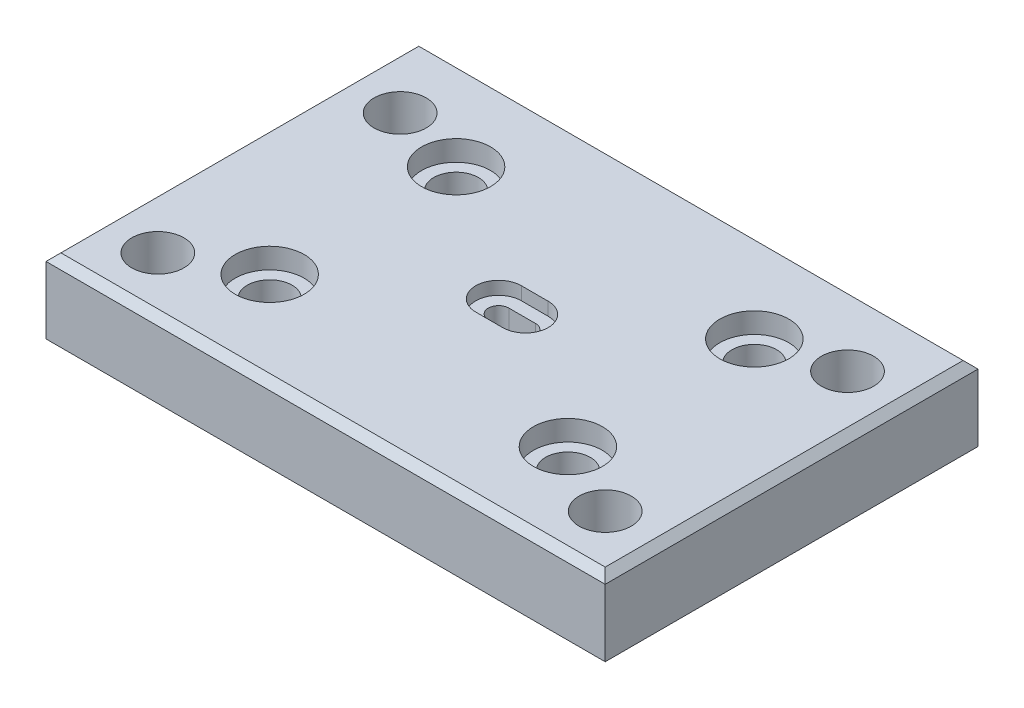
ISO-10303-21;
HEADER;
FILE_DESCRIPTION(('STEP AP214'),'2;1');
FILE_NAME('part.step','',(''),(''),'','','');
FILE_SCHEMA(('AUTOMOTIVE_DESIGN { 1 0 10303 214 1 1 1 1 }'));
ENDSEC;
DATA;
#1=APPLICATION_CONTEXT('core data for automotive mechanical design processes');
#2=APPLICATION_PROTOCOL_DEFINITION('international standard','automotive_design',2000,#1);
#3=PRODUCT_CONTEXT('',#1,'mechanical');
#4=PRODUCT('Part','Part','',(#3));
#5=PRODUCT_RELATED_PRODUCT_CATEGORY('part','',(#4));
#6=PRODUCT_DEFINITION_FORMATION('','',#4);
#7=PRODUCT_DEFINITION_CONTEXT('part definition',#1,'design');
#8=PRODUCT_DEFINITION('design','',#6,#7);
#9=PRODUCT_DEFINITION_SHAPE('','',#8);
#10=(LENGTH_UNIT() NAMED_UNIT(*) SI_UNIT(.MILLI.,.METRE.));
#11=(NAMED_UNIT(*) PLANE_ANGLE_UNIT() SI_UNIT($,.RADIAN.));
#12=(NAMED_UNIT(*) SI_UNIT($,.STERADIAN.) SOLID_ANGLE_UNIT());
#13=UNCERTAINTY_MEASURE_WITH_UNIT(LENGTH_MEASURE(1.E-05),#10,'distance_accuracy_value','');
#14=(GEOMETRIC_REPRESENTATION_CONTEXT(3) GLOBAL_UNCERTAINTY_ASSIGNED_CONTEXT((#13)) GLOBAL_UNIT_ASSIGNED_CONTEXT((#10,
#11,#12)) REPRESENTATION_CONTEXT('',''));
#15=CARTESIAN_POINT('',(0.,0.,0.));
#16=DIRECTION('',(0.,0.,1.));
#17=DIRECTION('',(1.,0.,0.));
#18=AXIS2_PLACEMENT_3D('',#15,#16,#17);
#19=CARTESIAN_POINT('',(-75.,20.,-50.));
#20=DIRECTION('',(1.,0.,0.));
#21=DIRECTION('',(0.,0.,-1.));
#22=AXIS2_PLACEMENT_3D('',#19,#20,#21);
#23=PLANE('',#22);
#24=DIRECTION('',(0.,-1.,0.));
#25=VECTOR('',#24,1.);
#26=CARTESIAN_POINT('',(-75.,20.,50.));
#27=LINE('',#26,#25);
#28=CARTESIAN_POINT('',(-75.,18.,50.));
#29=VERTEX_POINT('',#28);
#30=CARTESIAN_POINT('',(-75.,0.,50.));
#31=VERTEX_POINT('',#30);
#32=EDGE_CURVE('E322',#29,#31,#27,.T.);
#33=ORIENTED_EDGE('',*,*,#32,.F.);
#34=DIRECTION('',(0.,0.,-1.));
#35=VECTOR('',#34,1.);
#36=CARTESIAN_POINT('',(-75.,18.,-50.));
#37=LINE('',#36,#35);
#38=CARTESIAN_POINT('',(-75.,18.,-50.));
#39=VERTEX_POINT('',#38);
#40=EDGE_CURVE('E333',#29,#39,#37,.T.);
#41=ORIENTED_EDGE('',*,*,#40,.T.);
#42=DIRECTION('',(0.,-1.,0.));
#43=VECTOR('',#42,1.);
#44=CARTESIAN_POINT('',(-75.,20.,-50.));
#45=LINE('',#44,#43);
#46=CARTESIAN_POINT('',(-75.,0.,-50.));
#47=VERTEX_POINT('',#46);
#48=EDGE_CURVE('E316',#39,#47,#45,.T.);
#49=ORIENTED_EDGE('',*,*,#48,.T.);
#50=DIRECTION('',(0.,0.,1.));
#51=VECTOR('',#50,1.);
#52=CARTESIAN_POINT('',(-75.,0.,-50.));
#53=LINE('',#52,#51);
#54=EDGE_CURVE('E303',#47,#31,#53,.T.);
#55=ORIENTED_EDGE('',*,*,#54,.T.);
#56=EDGE_LOOP('',(#33,#41,#49,#55));
#57=FACE_BOUND('',#56,.T.);
#58=ADVANCED_FACE('F108',(#57),#23,.F.);
#59=CARTESIAN_POINT('',(-75.,20.,50.));
#60=DIRECTION('',(0.,0.,-1.));
#61=DIRECTION('',(-1.,0.,0.));
#62=AXIS2_PLACEMENT_3D('',#59,#60,#61);
#63=PLANE('',#62);
#64=DIRECTION('',(0.,-1.,0.));
#65=VECTOR('',#64,1.);
#66=CARTESIAN_POINT('',(75.,20.,50.));
#67=LINE('',#66,#65);
#68=CARTESIAN_POINT('',(75.,18.,50.));
#69=VERTEX_POINT('',#68);
#70=CARTESIAN_POINT('',(75.,0.,50.));
#71=VERTEX_POINT('',#70);
#72=EDGE_CURVE('E320',#69,#71,#67,.T.);
#73=ORIENTED_EDGE('',*,*,#72,.F.);
#74=DIRECTION('',(-1.,0.,0.));
#75=VECTOR('',#74,1.);
#76=CARTESIAN_POINT('',(-75.,18.,50.));
#77=LINE('',#76,#75);
#78=EDGE_CURVE('E340',#69,#29,#77,.T.);
#79=ORIENTED_EDGE('',*,*,#78,.T.);
#80=ORIENTED_EDGE('',*,*,#32,.T.);
#81=DIRECTION('',(1.,0.,0.));
#82=VECTOR('',#81,1.);
#83=CARTESIAN_POINT('',(-75.,0.,50.));
#84=LINE('',#83,#82);
#85=EDGE_CURVE('E306',#31,#71,#84,.T.);
#86=ORIENTED_EDGE('',*,*,#85,.T.);
#87=EDGE_LOOP('',(#73,#79,#80,#86));
#88=FACE_BOUND('',#87,.T.);
#89=ADVANCED_FACE('F417',(#88),#63,.F.);
#90=CARTESIAN_POINT('',(75.,20.,-50.));
#91=DIRECTION('',(-1.,0.,0.));
#92=DIRECTION('',(0.,0.,1.));
#93=AXIS2_PLACEMENT_3D('',#90,#91,#92);
#94=PLANE('',#93);
#95=DIRECTION('',(0.,-1.,0.));
#96=VECTOR('',#95,1.);
#97=CARTESIAN_POINT('',(75.,20.,-50.));
#98=LINE('',#97,#96);
#99=CARTESIAN_POINT('',(75.,18.,-50.));
#100=VERTEX_POINT('',#99);
#101=CARTESIAN_POINT('',(75.,0.,-50.));
#102=VERTEX_POINT('',#101);
#103=EDGE_CURVE('E318',#100,#102,#98,.T.);
#104=ORIENTED_EDGE('',*,*,#103,.F.);
#105=DIRECTION('',(0.,0.,1.));
#106=VECTOR('',#105,1.);
#107=CARTESIAN_POINT('',(75.,18.,50.));
#108=LINE('',#107,#106);
#109=EDGE_CURVE('E338',#100,#69,#108,.T.);
#110=ORIENTED_EDGE('',*,*,#109,.T.);
#111=ORIENTED_EDGE('',*,*,#72,.T.);
#112=DIRECTION('',(0.,0.,-1.));
#113=VECTOR('',#112,1.);
#114=CARTESIAN_POINT('',(75.,0.,-50.));
#115=LINE('',#114,#113);
#116=EDGE_CURVE('E310',#71,#102,#115,.T.);
#117=ORIENTED_EDGE('',*,*,#116,.T.);
#118=EDGE_LOOP('',(#104,#110,#111,#117));
#119=FACE_BOUND('',#118,.T.);
#120=ADVANCED_FACE('F423',(#119),#94,.F.);
#121=CARTESIAN_POINT('',(-75.,20.,-50.));
#122=DIRECTION('',(0.,0.,1.));
#123=DIRECTION('',(1.,0.,0.));
#124=AXIS2_PLACEMENT_3D('',#121,#122,#123);
#125=PLANE('',#124);
#126=ORIENTED_EDGE('',*,*,#48,.F.);
#127=DIRECTION('',(1.,0.,0.));
#128=VECTOR('',#127,1.);
#129=CARTESIAN_POINT('',(75.,18.,-50.));
#130=LINE('',#129,#128);
#131=EDGE_CURVE('E336',#39,#100,#130,.T.);
#132=ORIENTED_EDGE('',*,*,#131,.T.);
#133=ORIENTED_EDGE('',*,*,#103,.T.);
#134=DIRECTION('',(-1.,0.,0.));
#135=VECTOR('',#134,1.);
#136=CARTESIAN_POINT('',(-75.,0.,-50.));
#137=LINE('',#136,#135);
#138=EDGE_CURVE('E313',#102,#47,#137,.T.);
#139=ORIENTED_EDGE('',*,*,#138,.T.);
#140=EDGE_LOOP('',(#126,#132,#133,#139));
#141=FACE_BOUND('',#140,.T.);
#142=ADVANCED_FACE('F478',(#141),#125,.F.);
#143=CARTESIAN_POINT('',(-75.,20.,50.));
#144=DIRECTION('',(0.,1.,0.));
#145=DIRECTION('',(0.,0.,1.));
#146=AXIS2_PLACEMENT_3D('',#143,#144,#145);
#147=PLANE('',#146);
#148=CARTESIAN_POINT('',(3.6,20.,0.));
#149=DIRECTION('',(0.,1.,0.));
#150=DIRECTION('',(0.,0.,1.));
#151=AXIS2_PLACEMENT_3D('',#148,#149,#150);
#152=CIRCLE('',#151,6.119);
#153=CARTESIAN_POINT('',(3.6,20.,6.11900000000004));
#154=VERTEX_POINT('',#153);
#155=CARTESIAN_POINT('',(3.6,20.,-6.119));
#156=VERTEX_POINT('',#155);
#157=EDGE_CURVE('E242',#154,#156,#152,.T.);
#158=ORIENTED_EDGE('',*,*,#157,.F.);
#159=DIRECTION('',(1.,0.,0.));
#160=VECTOR('',#159,1.);
#161=CARTESIAN_POINT('',(-3.6,20.,6.11900000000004));
#162=LINE('',#161,#160);
#163=CARTESIAN_POINT('',(-3.6,20.,6.119));
#164=VERTEX_POINT('',#163);
#165=EDGE_CURVE('E771',#164,#154,#162,.T.);
#166=ORIENTED_EDGE('',*,*,#165,.F.);
#167=CARTESIAN_POINT('',(-3.6,20.,0.));
#168=DIRECTION('',(0.,1.,0.));
#169=DIRECTION('',(0.,0.,1.));
#170=AXIS2_PLACEMENT_3D('',#167,#168,#169);
#171=CIRCLE('',#170,6.119);
#172=CARTESIAN_POINT('',(-3.6,20.,-6.119));
#173=VERTEX_POINT('',#172);
#174=EDGE_CURVE('E231',#173,#164,#171,.T.);
#175=ORIENTED_EDGE('',*,*,#174,.F.);
#176=DIRECTION('',(1.,0.,0.));
#177=VECTOR('',#176,1.);
#178=CARTESIAN_POINT('',(-3.6,20.,-6.119));
#179=LINE('',#178,#177);
#180=EDGE_CURVE('E219',#173,#156,#179,.T.);
#181=ORIENTED_EDGE('',*,*,#180,.T.);
#182=EDGE_LOOP('',(#158,#166,#175,#181));
#183=FACE_BOUND('',#182,.T.);
#184=CARTESIAN_POINT('',(60.,20.,-30.));
#185=DIRECTION('',(0.,1.,0.));
#186=DIRECTION('',(0.,0.,1.));
#187=AXIS2_PLACEMENT_3D('',#184,#185,#186);
#188=CIRCLE('',#187,6.99999999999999);
#189=CARTESIAN_POINT('',(60.,20.,-23.));
#190=VERTEX_POINT('',#189);
#191=EDGE_CURVE('E257',#190,#190,#188,.T.);
#192=ORIENTED_EDGE('',*,*,#191,.F.);
#193=EDGE_LOOP('',(#192));
#194=FACE_BOUND('',#193,.T.);
#195=CARTESIAN_POINT('',(-60.,20.,-30.));
#196=DIRECTION('',(0.,1.,0.));
#197=DIRECTION('',(0.,0.,1.));
#198=AXIS2_PLACEMENT_3D('',#195,#196,#197);
#199=CIRCLE('',#198,6.99999999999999);
#200=CARTESIAN_POINT('',(-60.,20.,-23.));
#201=VERTEX_POINT('',#200);
#202=EDGE_CURVE('E263',#201,#201,#199,.T.);
#203=ORIENTED_EDGE('',*,*,#202,.F.);
#204=EDGE_LOOP('',(#203));
#205=FACE_BOUND('',#204,.T.);
#206=CARTESIAN_POINT('',(60.,20.,35.));
#207=DIRECTION('',(0.,1.,0.));
#208=DIRECTION('',(0.,0.,1.));
#209=AXIS2_PLACEMENT_3D('',#206,#207,#208);
#210=CIRCLE('',#209,6.99999999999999);
#211=CARTESIAN_POINT('',(60.,20.,42.));
#212=VERTEX_POINT('',#211);
#213=EDGE_CURVE('E269',#212,#212,#210,.T.);
#214=ORIENTED_EDGE('',*,*,#213,.F.);
#215=EDGE_LOOP('',(#214));
#216=FACE_BOUND('',#215,.T.);
#217=CARTESIAN_POINT('',(-60.,20.,35.));
#218=DIRECTION('',(0.,1.,0.));
#219=DIRECTION('',(0.,0.,1.));
#220=AXIS2_PLACEMENT_3D('',#217,#218,#219);
#221=CIRCLE('',#220,6.99999999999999);
#222=CARTESIAN_POINT('',(-60.,20.,42.));
#223=VERTEX_POINT('',#222);
#224=EDGE_CURVE('E275',#223,#223,#221,.T.);
#225=ORIENTED_EDGE('',*,*,#224,.F.);
#226=EDGE_LOOP('',(#225));
#227=FACE_BOUND('',#226,.T.);
#228=CARTESIAN_POINT('',(40.,20.,25.));
#229=DIRECTION('',(0.,1.,0.));
#230=DIRECTION('',(0.,0.,1.));
#231=AXIS2_PLACEMENT_3D('',#228,#229,#230);
#232=CIRCLE('',#231,9.24999999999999);
#233=CARTESIAN_POINT('',(40.,20.,34.25));
#234=VERTEX_POINT('',#233);
#235=EDGE_CURVE('E281',#234,#234,#232,.T.);
#236=ORIENTED_EDGE('',*,*,#235,.F.);
#237=EDGE_LOOP('',(#236));
#238=FACE_BOUND('',#237,.T.);
#239=CARTESIAN_POINT('',(-40.,20.,25.));
#240=DIRECTION('',(0.,1.,0.));
#241=DIRECTION('',(0.,0.,1.));
#242=AXIS2_PLACEMENT_3D('',#239,#240,#241);
#243=CIRCLE('',#242,9.24999999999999);
#244=CARTESIAN_POINT('',(-40.,20.,34.25));
#245=VERTEX_POINT('',#244);
#246=EDGE_CURVE('E299',#245,#245,#243,.T.);
#247=ORIENTED_EDGE('',*,*,#246,.F.);
#248=EDGE_LOOP('',(#247));
#249=FACE_BOUND('',#248,.T.);
#250=DIRECTION('',(-1.,0.,0.));
#251=VECTOR('',#250,1.);
#252=CARTESIAN_POINT('',(-75.,20.,-48.));
#253=LINE('',#252,#251);
#254=CARTESIAN_POINT('',(73.,20.,-48.));
#255=VERTEX_POINT('',#254);
#256=CARTESIAN_POINT('',(-73.,20.,-48.));
#257=VERTEX_POINT('',#256);
#258=EDGE_CURVE('E328',#255,#257,#253,.T.);
#259=ORIENTED_EDGE('',*,*,#258,.T.);
#260=DIRECTION('',(0.,0.,1.));
#261=VECTOR('',#260,1.);
#262=CARTESIAN_POINT('',(-73.,20.,50.));
#263=LINE('',#262,#261);
#264=CARTESIAN_POINT('',(-73.,20.,48.));
#265=VERTEX_POINT('',#264);
#266=EDGE_CURVE('E330',#257,#265,#263,.T.);
#267=ORIENTED_EDGE('',*,*,#266,.T.);
#268=DIRECTION('',(1.,0.,0.));
#269=VECTOR('',#268,1.);
#270=CARTESIAN_POINT('',(75.,20.,48.));
#271=LINE('',#270,#269);
#272=CARTESIAN_POINT('',(73.,20.,48.));
#273=VERTEX_POINT('',#272);
#274=EDGE_CURVE('E324',#265,#273,#271,.T.);
#275=ORIENTED_EDGE('',*,*,#274,.T.);
#276=DIRECTION('',(0.,0.,-1.));
#277=VECTOR('',#276,1.);
#278=CARTESIAN_POINT('',(73.,20.,-50.));
#279=LINE('',#278,#277);
#280=EDGE_CURVE('E326',#273,#255,#279,.T.);
#281=ORIENTED_EDGE('',*,*,#280,.T.);
#282=EDGE_LOOP('',(#259,#267,#275,#281));
#283=FACE_BOUND('',#282,.T.);
#284=CARTESIAN_POINT('',(-40.,20.,-25.));
#285=DIRECTION('',(0.,1.,0.));
#286=DIRECTION('',(0.,0.,1.));
#287=AXIS2_PLACEMENT_3D('',#284,#285,#286);
#288=CIRCLE('',#287,9.24999999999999);
#289=CARTESIAN_POINT('',(-40.,20.,-15.75));
#290=VERTEX_POINT('',#289);
#291=EDGE_CURVE('E353',#290,#290,#288,.T.);
#292=ORIENTED_EDGE('',*,*,#291,.F.);
#293=EDGE_LOOP('',(#292));
#294=FACE_BOUND('',#293,.T.);
#295=CARTESIAN_POINT('',(40.,20.,-25.));
#296=DIRECTION('',(0.,1.,0.));
#297=DIRECTION('',(0.,0.,1.));
#298=AXIS2_PLACEMENT_3D('',#295,#296,#297);
#299=CIRCLE('',#298,9.24999999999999);
#300=CARTESIAN_POINT('',(40.,20.,-15.75));
#301=VERTEX_POINT('',#300);
#302=EDGE_CURVE('E365',#301,#301,#299,.T.);
#303=ORIENTED_EDGE('',*,*,#302,.F.);
#304=EDGE_LOOP('',(#303));
#305=FACE_BOUND('',#304,.T.);
#306=ADVANCED_FACE('F476',(#183,#194,#205,#216,#227,#238,#249,#283,#294,#305),#147,.T.);
#307=CARTESIAN_POINT('',(-75.,0.,50.));
#308=DIRECTION('',(0.,1.,0.));
#309=DIRECTION('',(0.,0.,1.));
#310=AXIS2_PLACEMENT_3D('',#307,#308,#309);
#311=PLANE('',#310);
#312=CARTESIAN_POINT('',(3.6,0.,0.));
#313=DIRECTION('',(0.,1.,0.));
#314=DIRECTION('',(0.,0.,1.));
#315=AXIS2_PLACEMENT_3D('',#312,#313,#314);
#316=CIRCLE('',#315,2.75);
#317=CARTESIAN_POINT('',(3.59999999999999,0.,2.75));
#318=VERTEX_POINT('',#317);
#319=CARTESIAN_POINT('',(3.6,0.,-2.75));
#320=VERTEX_POINT('',#319);
#321=EDGE_CURVE('E116',#318,#320,#316,.T.);
#322=ORIENTED_EDGE('',*,*,#321,.T.);
#323=DIRECTION('',(-1.,0.,0.));
#324=VECTOR('',#323,1.);
#325=CARTESIAN_POINT('',(-75.,0.,-2.74999999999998));
#326=LINE('',#325,#324);
#327=CARTESIAN_POINT('',(-3.6,0.,-2.74999999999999));
#328=VERTEX_POINT('',#327);
#329=EDGE_CURVE('E13',#320,#328,#326,.T.);
#330=ORIENTED_EDGE('',*,*,#329,.T.);
#331=CARTESIAN_POINT('',(-3.6,0.,0.));
#332=DIRECTION('',(0.,1.,0.));
#333=DIRECTION('',(0.,0.,1.));
#334=AXIS2_PLACEMENT_3D('',#331,#332,#333);
#335=CIRCLE('',#334,2.75);
#336=CARTESIAN_POINT('',(-3.6,0.,2.75));
#337=VERTEX_POINT('',#336);
#338=EDGE_CURVE('E377',#328,#337,#335,.T.);
#339=ORIENTED_EDGE('',*,*,#338,.T.);
#340=DIRECTION('',(1.,0.,0.));
#341=VECTOR('',#340,1.);
#342=CARTESIAN_POINT('',(-75.,0.,2.75000000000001));
#343=LINE('',#342,#341);
#344=EDGE_CURVE('E374',#337,#318,#343,.T.);
#345=ORIENTED_EDGE('',*,*,#344,.T.);
#346=EDGE_LOOP('',(#322,#330,#339,#345));
#347=FACE_BOUND('',#346,.T.);
#348=CARTESIAN_POINT('',(60.,0.,-30.));
#349=DIRECTION('',(0.,1.,0.));
#350=DIRECTION('',(0.,0.,1.));
#351=AXIS2_PLACEMENT_3D('',#348,#349,#350);
#352=CIRCLE('',#351,6.99999999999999);
#353=CARTESIAN_POINT('',(60.,0.,-23.));
#354=VERTEX_POINT('',#353);
#355=EDGE_CURVE('E254',#354,#354,#352,.T.);
#356=ORIENTED_EDGE('',*,*,#355,.T.);
#357=EDGE_LOOP('',(#356));
#358=FACE_BOUND('',#357,.T.);
#359=CARTESIAN_POINT('',(-60.,0.,-30.));
#360=DIRECTION('',(0.,1.,0.));
#361=DIRECTION('',(0.,0.,1.));
#362=AXIS2_PLACEMENT_3D('',#359,#360,#361);
#363=CIRCLE('',#362,6.99999999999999);
#364=CARTESIAN_POINT('',(-60.,0.,-23.));
#365=VERTEX_POINT('',#364);
#366=EDGE_CURVE('E260',#365,#365,#363,.T.);
#367=ORIENTED_EDGE('',*,*,#366,.T.);
#368=EDGE_LOOP('',(#367));
#369=FACE_BOUND('',#368,.T.);
#370=CARTESIAN_POINT('',(60.,0.,35.));
#371=DIRECTION('',(0.,1.,0.));
#372=DIRECTION('',(0.,0.,1.));
#373=AXIS2_PLACEMENT_3D('',#370,#371,#372);
#374=CIRCLE('',#373,6.99999999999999);
#375=CARTESIAN_POINT('',(60.,0.,42.));
#376=VERTEX_POINT('',#375);
#377=EDGE_CURVE('E266',#376,#376,#374,.T.);
#378=ORIENTED_EDGE('',*,*,#377,.T.);
#379=EDGE_LOOP('',(#378));
#380=FACE_BOUND('',#379,.T.);
#381=CARTESIAN_POINT('',(-60.,0.,35.));
#382=DIRECTION('',(0.,1.,0.));
#383=DIRECTION('',(0.,0.,1.));
#384=AXIS2_PLACEMENT_3D('',#381,#382,#383);
#385=CIRCLE('',#384,6.99999999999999);
#386=CARTESIAN_POINT('',(-60.,0.,42.));
#387=VERTEX_POINT('',#386);
#388=EDGE_CURVE('E272',#387,#387,#385,.T.);
#389=ORIENTED_EDGE('',*,*,#388,.T.);
#390=EDGE_LOOP('',(#389));
#391=FACE_BOUND('',#390,.T.);
#392=CARTESIAN_POINT('',(40.,0.,25.));
#393=DIRECTION('',(0.,1.,0.));
#394=DIRECTION('',(0.,0.,1.));
#395=AXIS2_PLACEMENT_3D('',#392,#393,#394);
#396=CIRCLE('',#395,6.);
#397=CARTESIAN_POINT('',(40.,0.,31.));
#398=VERTEX_POINT('',#397);
#399=EDGE_CURVE('E278',#398,#398,#396,.T.);
#400=ORIENTED_EDGE('',*,*,#399,.T.);
#401=EDGE_LOOP('',(#400));
#402=FACE_BOUND('',#401,.T.);
#403=CARTESIAN_POINT('',(-40.,0.,25.));
#404=DIRECTION('',(0.,1.,0.));
#405=DIRECTION('',(0.,0.,1.));
#406=AXIS2_PLACEMENT_3D('',#403,#404,#405);
#407=CIRCLE('',#406,6.);
#408=CARTESIAN_POINT('',(-40.,0.,31.));
#409=VERTEX_POINT('',#408);
#410=EDGE_CURVE('E290',#409,#409,#407,.T.);
#411=ORIENTED_EDGE('',*,*,#410,.T.);
#412=EDGE_LOOP('',(#411));
#413=FACE_BOUND('',#412,.T.);
#414=ORIENTED_EDGE('',*,*,#54,.F.);
#415=ORIENTED_EDGE('',*,*,#138,.F.);
#416=ORIENTED_EDGE('',*,*,#116,.F.);
#417=ORIENTED_EDGE('',*,*,#85,.F.);
#418=EDGE_LOOP('',(#414,#415,#416,#417));
#419=FACE_BOUND('',#418,.T.);
#420=CARTESIAN_POINT('',(-40.,0.,-25.));
#421=DIRECTION('',(0.,1.,0.));
#422=DIRECTION('',(0.,0.,1.));
#423=AXIS2_PLACEMENT_3D('',#420,#421,#422);
#424=CIRCLE('',#423,6.);
#425=CARTESIAN_POINT('',(-40.,0.,-19.));
#426=VERTEX_POINT('',#425);
#427=EDGE_CURVE('E342',#426,#426,#424,.T.);
#428=ORIENTED_EDGE('',*,*,#427,.T.);
#429=EDGE_LOOP('',(#428));
#430=FACE_BOUND('',#429,.T.);
#431=CARTESIAN_POINT('',(40.,0.,-25.));
#432=DIRECTION('',(0.,1.,0.));
#433=DIRECTION('',(0.,0.,1.));
#434=AXIS2_PLACEMENT_3D('',#431,#432,#433);
#435=CIRCLE('',#434,6.);
#436=CARTESIAN_POINT('',(40.,0.,-19.));
#437=VERTEX_POINT('',#436);
#438=EDGE_CURVE('E362',#437,#437,#435,.T.);
#439=ORIENTED_EDGE('',*,*,#438,.T.);
#440=EDGE_LOOP('',(#439));
#441=FACE_BOUND('',#440,.T.);
#442=ADVANCED_FACE('F381',(#347,#358,#369,#380,#391,#402,#413,#419,#430,#441),#311,.F.);
#443=CARTESIAN_POINT('',(73.,20.,50.));
#444=DIRECTION('',(0.707106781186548,0.707106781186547,0.));
#445=DIRECTION('',(-0.707106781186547,0.707106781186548,0.));
#446=AXIS2_PLACEMENT_3D('',#443,#444,#445);
#447=PLANE('',#446);
#448=DIRECTION('',(-0.577350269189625,0.577350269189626,-0.577350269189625));
#449=VECTOR('',#448,1.);
#450=CARTESIAN_POINT('',(23.6666666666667,69.3333333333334,-1.33333333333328));
#451=LINE('',#450,#449);
#452=EDGE_CURVE('E346',#69,#273,#451,.T.);
#453=ORIENTED_EDGE('',*,*,#452,.F.);
#454=ORIENTED_EDGE('',*,*,#109,.F.);
#455=DIRECTION('',(-0.577350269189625,0.577350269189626,0.577350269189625));
#456=VECTOR('',#455,1.);
#457=CARTESIAN_POINT('',(40.3333333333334,52.6666666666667,-15.3333333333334));
#458=LINE('',#457,#456);
#459=EDGE_CURVE('E307',#255,#100,#458,.F.);
#460=ORIENTED_EDGE('',*,*,#459,.F.);
#461=ORIENTED_EDGE('',*,*,#280,.F.);
#462=EDGE_LOOP('',(#453,#454,#460,#461));
#463=FACE_BOUND('',#462,.T.);
#464=ADVANCED_FACE('F441',(#463),#447,.T.);
#465=CARTESIAN_POINT('',(-75.,20.,-48.));
#466=DIRECTION('',(0.,0.707106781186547,-0.707106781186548));
#467=DIRECTION('',(0.,0.707106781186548,0.707106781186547));
#468=AXIS2_PLACEMENT_3D('',#465,#466,#467);
#469=PLANE('',#468);
#470=ORIENTED_EDGE('',*,*,#459,.T.);
#471=ORIENTED_EDGE('',*,*,#131,.F.);
#472=DIRECTION('',(0.577350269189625,0.577350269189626,0.577350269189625));
#473=VECTOR('',#472,1.);
#474=CARTESIAN_POINT('',(-73.6666666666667,19.3333333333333,-48.6666666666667));
#475=LINE('',#474,#473);
#476=EDGE_CURVE('E344',#257,#39,#475,.F.);
#477=ORIENTED_EDGE('',*,*,#476,.F.);
#478=ORIENTED_EDGE('',*,*,#258,.F.);
#479=EDGE_LOOP('',(#470,#471,#477,#478));
#480=FACE_BOUND('',#479,.T.);
#481=ADVANCED_FACE('F437',(#480),#469,.T.);
#482=CARTESIAN_POINT('',(-75.,20.,48.));
#483=DIRECTION('',(0.,0.707106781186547,0.707106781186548));
#484=DIRECTION('',(0.,-0.707106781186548,0.707106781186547));
#485=AXIS2_PLACEMENT_3D('',#482,#483,#484);
#486=PLANE('',#485);
#487=ORIENTED_EDGE('',*,*,#452,.T.);
#488=ORIENTED_EDGE('',*,*,#274,.F.);
#489=DIRECTION('',(-0.577350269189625,-0.577350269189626,0.577350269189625));
#490=VECTOR('',#489,1.);
#491=CARTESIAN_POINT('',(-73.6666666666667,19.3333333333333,48.6666666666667));
#492=LINE('',#491,#490);
#493=EDGE_CURVE('E302',#29,#265,#492,.F.);
#494=ORIENTED_EDGE('',*,*,#493,.F.);
#495=ORIENTED_EDGE('',*,*,#78,.F.);
#496=EDGE_LOOP('',(#487,#488,#494,#495));
#497=FACE_BOUND('',#496,.T.);
#498=ADVANCED_FACE('F433',(#497),#486,.T.);
#499=CARTESIAN_POINT('',(-73.,20.,50.));
#500=DIRECTION('',(-0.707106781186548,0.707106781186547,0.));
#501=DIRECTION('',(-0.707106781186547,-0.707106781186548,0.));
#502=AXIS2_PLACEMENT_3D('',#499,#500,#501);
#503=PLANE('',#502);
#504=ORIENTED_EDGE('',*,*,#476,.T.);
#505=ORIENTED_EDGE('',*,*,#40,.F.);
#506=ORIENTED_EDGE('',*,*,#493,.T.);
#507=ORIENTED_EDGE('',*,*,#266,.F.);
#508=EDGE_LOOP('',(#504,#505,#506,#507));
#509=FACE_BOUND('',#508,.T.);
#510=ADVANCED_FACE('F429',(#509),#503,.T.);
#511=CARTESIAN_POINT('',(-40.,20.,25.));
#512=DIRECTION('',(0.,1.,0.));
#513=DIRECTION('',(0.,0.,1.));
#514=AXIS2_PLACEMENT_3D('',#511,#512,#513);
#515=CYLINDRICAL_SURFACE('',#514,9.24999999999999);
#516=CARTESIAN_POINT('',(-40.,14.5,25.));
#517=DIRECTION('',(0.,1.,0.));
#518=DIRECTION('',(0.,0.,1.));
#519=AXIS2_PLACEMENT_3D('',#516,#517,#518);
#520=CIRCLE('',#519,9.24999999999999);
#521=CARTESIAN_POINT('',(-40.,14.5,34.25));
#522=VERTEX_POINT('',#521);
#523=EDGE_CURVE('E296',#522,#522,#520,.T.);
#524=ORIENTED_EDGE('',*,*,#523,.F.);
#525=EDGE_LOOP('',(#524));
#526=FACE_BOUND('',#525,.T.);
#527=ORIENTED_EDGE('',*,*,#246,.T.);
#528=EDGE_LOOP('',(#527));
#529=FACE_BOUND('',#528,.T.);
#530=ADVANCED_FACE('F432',(#526,#529),#515,.F.);
#531=CARTESIAN_POINT('',(-34.,14.5,25.));
#532=DIRECTION('',(0.,-1.,0.));
#533=DIRECTION('',(0.,0.,-1.));
#534=AXIS2_PLACEMENT_3D('',#531,#532,#533);
#535=PLANE('',#534);
#536=CARTESIAN_POINT('',(-40.,14.5,25.));
#537=DIRECTION('',(0.,1.,0.));
#538=DIRECTION('',(0.,0.,1.));
#539=AXIS2_PLACEMENT_3D('',#536,#537,#538);
#540=CIRCLE('',#539,6.);
#541=CARTESIAN_POINT('',(-40.,14.5,31.));
#542=VERTEX_POINT('',#541);
#543=EDGE_CURVE('E293',#542,#542,#540,.T.);
#544=ORIENTED_EDGE('',*,*,#543,.F.);
#545=EDGE_LOOP('',(#544));
#546=FACE_BOUND('',#545,.T.);
#547=ORIENTED_EDGE('',*,*,#523,.T.);
#548=EDGE_LOOP('',(#547));
#549=FACE_BOUND('',#548,.T.);
#550=ADVANCED_FACE('F570',(#546,#549),#535,.F.);
#551=CARTESIAN_POINT('',(-40.,20.,25.));
#552=DIRECTION('',(0.,1.,0.));
#553=DIRECTION('',(0.,0.,1.));
#554=AXIS2_PLACEMENT_3D('',#551,#552,#553);
#555=CYLINDRICAL_SURFACE('',#554,6.);
#556=ORIENTED_EDGE('',*,*,#410,.F.);
#557=EDGE_LOOP('',(#556));
#558=FACE_BOUND('',#557,.T.);
#559=ORIENTED_EDGE('',*,*,#543,.T.);
#560=EDGE_LOOP('',(#559));
#561=FACE_BOUND('',#560,.T.);
#562=ADVANCED_FACE('F579',(#558,#561),#555,.F.);
#563=CARTESIAN_POINT('',(40.,20.,25.));
#564=DIRECTION('',(0.,1.,0.));
#565=DIRECTION('',(0.,0.,1.));
#566=AXIS2_PLACEMENT_3D('',#563,#564,#565);
#567=CYLINDRICAL_SURFACE('',#566,9.24999999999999);
#568=CARTESIAN_POINT('',(40.,14.5,25.));
#569=DIRECTION('',(0.,1.,0.));
#570=DIRECTION('',(0.,0.,1.));
#571=AXIS2_PLACEMENT_3D('',#568,#569,#570);
#572=CIRCLE('',#571,9.24999999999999);
#573=CARTESIAN_POINT('',(40.,14.5,34.25));
#574=VERTEX_POINT('',#573);
#575=EDGE_CURVE('E287',#574,#574,#572,.T.);
#576=ORIENTED_EDGE('',*,*,#575,.F.);
#577=EDGE_LOOP('',(#576));
#578=FACE_BOUND('',#577,.T.);
#579=ORIENTED_EDGE('',*,*,#235,.T.);
#580=EDGE_LOOP('',(#579));
#581=FACE_BOUND('',#580,.T.);
#582=ADVANCED_FACE('F588',(#578,#581),#567,.F.);
#583=CARTESIAN_POINT('',(46.,14.5,25.));
#584=DIRECTION('',(0.,-1.,0.));
#585=DIRECTION('',(0.,0.,-1.));
#586=AXIS2_PLACEMENT_3D('',#583,#584,#585);
#587=PLANE('',#586);
#588=CARTESIAN_POINT('',(40.,14.5,25.));
#589=DIRECTION('',(0.,1.,0.));
#590=DIRECTION('',(0.,0.,1.));
#591=AXIS2_PLACEMENT_3D('',#588,#589,#590);
#592=CIRCLE('',#591,6.);
#593=CARTESIAN_POINT('',(40.,14.5,31.));
#594=VERTEX_POINT('',#593);
#595=EDGE_CURVE('E284',#594,#594,#592,.T.);
#596=ORIENTED_EDGE('',*,*,#595,.F.);
#597=EDGE_LOOP('',(#596));
#598=FACE_BOUND('',#597,.T.);
#599=ORIENTED_EDGE('',*,*,#575,.T.);
#600=EDGE_LOOP('',(#599));
#601=FACE_BOUND('',#600,.T.);
#602=ADVANCED_FACE('F598',(#598,#601),#587,.F.);
#603=CARTESIAN_POINT('',(40.,20.,25.));
#604=DIRECTION('',(0.,1.,0.));
#605=DIRECTION('',(0.,0.,1.));
#606=AXIS2_PLACEMENT_3D('',#603,#604,#605);
#607=CYLINDRICAL_SURFACE('',#606,6.);
#608=ORIENTED_EDGE('',*,*,#399,.F.);
#609=EDGE_LOOP('',(#608));
#610=FACE_BOUND('',#609,.T.);
#611=ORIENTED_EDGE('',*,*,#595,.T.);
#612=EDGE_LOOP('',(#611));
#613=FACE_BOUND('',#612,.T.);
#614=ADVANCED_FACE('F457',(#610,#613),#607,.F.);
#615=CARTESIAN_POINT('',(-40.,20.,-25.));
#616=DIRECTION('',(0.,1.,0.));
#617=DIRECTION('',(0.,0.,1.));
#618=AXIS2_PLACEMENT_3D('',#615,#616,#617);
#619=CYLINDRICAL_SURFACE('',#618,6.);
#620=ORIENTED_EDGE('',*,*,#427,.F.);
#621=EDGE_LOOP('',(#620));
#622=FACE_BOUND('',#621,.T.);
#623=CARTESIAN_POINT('',(-40.,14.5,-25.));
#624=DIRECTION('',(0.,1.,0.));
#625=DIRECTION('',(0.,0.,1.));
#626=AXIS2_PLACEMENT_3D('',#623,#624,#625);
#627=CIRCLE('',#626,6.);
#628=CARTESIAN_POINT('',(-40.,14.5,-19.));
#629=VERTEX_POINT('',#628);
#630=EDGE_CURVE('E359',#629,#629,#627,.T.);
#631=ORIENTED_EDGE('',*,*,#630,.T.);
#632=EDGE_LOOP('',(#631));
#633=FACE_BOUND('',#632,.T.);
#634=ADVANCED_FACE('F453',(#622,#633),#619,.F.);
#635=CARTESIAN_POINT('',(-34.,14.5,-25.));
#636=DIRECTION('',(0.,-1.,0.));
#637=DIRECTION('',(0.,0.,-1.));
#638=AXIS2_PLACEMENT_3D('',#635,#636,#637);
#639=PLANE('',#638);
#640=ORIENTED_EDGE('',*,*,#630,.F.);
#641=EDGE_LOOP('',(#640));
#642=FACE_BOUND('',#641,.T.);
#643=CARTESIAN_POINT('',(-40.,14.5,-25.));
#644=DIRECTION('',(0.,1.,0.));
#645=DIRECTION('',(0.,0.,1.));
#646=AXIS2_PLACEMENT_3D('',#643,#644,#645);
#647=CIRCLE('',#646,9.24999999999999);
#648=CARTESIAN_POINT('',(-40.,14.5,-15.75));
#649=VERTEX_POINT('',#648);
#650=EDGE_CURVE('E356',#649,#649,#647,.T.);
#651=ORIENTED_EDGE('',*,*,#650,.T.);
#652=EDGE_LOOP('',(#651));
#653=FACE_BOUND('',#652,.T.);
#654=ADVANCED_FACE('F449',(#642,#653),#639,.F.);
#655=CARTESIAN_POINT('',(-40.,20.,-25.));
#656=DIRECTION('',(0.,1.,0.));
#657=DIRECTION('',(0.,0.,1.));
#658=AXIS2_PLACEMENT_3D('',#655,#656,#657);
#659=CYLINDRICAL_SURFACE('',#658,9.24999999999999);
#660=ORIENTED_EDGE('',*,*,#650,.F.);
#661=EDGE_LOOP('',(#660));
#662=FACE_BOUND('',#661,.T.);
#663=ORIENTED_EDGE('',*,*,#291,.T.);
#664=EDGE_LOOP('',(#663));
#665=FACE_BOUND('',#664,.T.);
#666=ADVANCED_FACE('F446',(#662,#665),#659,.F.);
#667=CARTESIAN_POINT('',(40.,20.,-25.));
#668=DIRECTION('',(0.,1.,0.));
#669=DIRECTION('',(0.,0.,1.));
#670=AXIS2_PLACEMENT_3D('',#667,#668,#669);
#671=CYLINDRICAL_SURFACE('',#670,6.);
#672=ORIENTED_EDGE('',*,*,#438,.F.);
#673=EDGE_LOOP('',(#672));
#674=FACE_BOUND('',#673,.T.);
#675=CARTESIAN_POINT('',(40.,14.5,-25.));
#676=DIRECTION('',(0.,1.,0.));
#677=DIRECTION('',(0.,0.,1.));
#678=AXIS2_PLACEMENT_3D('',#675,#676,#677);
#679=CIRCLE('',#678,6.);
#680=CARTESIAN_POINT('',(40.,14.5,-19.));
#681=VERTEX_POINT('',#680);
#682=EDGE_CURVE('E371',#681,#681,#679,.T.);
#683=ORIENTED_EDGE('',*,*,#682,.T.);
#684=EDGE_LOOP('',(#683));
#685=FACE_BOUND('',#684,.T.);
#686=ADVANCED_FACE('F110',(#674,#685),#671,.F.);
#687=CARTESIAN_POINT('',(46.,14.5,-25.));
#688=DIRECTION('',(0.,-1.,0.));
#689=DIRECTION('',(0.,0.,-1.));
#690=AXIS2_PLACEMENT_3D('',#687,#688,#689);
#691=PLANE('',#690);
#692=ORIENTED_EDGE('',*,*,#682,.F.);
#693=EDGE_LOOP('',(#692));
#694=FACE_BOUND('',#693,.T.);
#695=CARTESIAN_POINT('',(40.,14.5,-25.));
#696=DIRECTION('',(0.,1.,0.));
#697=DIRECTION('',(0.,0.,1.));
#698=AXIS2_PLACEMENT_3D('',#695,#696,#697);
#699=CIRCLE('',#698,9.24999999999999);
#700=CARTESIAN_POINT('',(40.,14.5,-15.75));
#701=VERTEX_POINT('',#700);
#702=EDGE_CURVE('E368',#701,#701,#699,.T.);
#703=ORIENTED_EDGE('',*,*,#702,.T.);
#704=EDGE_LOOP('',(#703));
#705=FACE_BOUND('',#704,.T.);
#706=ADVANCED_FACE('F462',(#694,#705),#691,.F.);
#707=CARTESIAN_POINT('',(40.,20.,-25.));
#708=DIRECTION('',(0.,1.,0.));
#709=DIRECTION('',(0.,0.,1.));
#710=AXIS2_PLACEMENT_3D('',#707,#708,#709);
#711=CYLINDRICAL_SURFACE('',#710,9.24999999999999);
#712=ORIENTED_EDGE('',*,*,#702,.F.);
#713=EDGE_LOOP('',(#712));
#714=FACE_BOUND('',#713,.T.);
#715=ORIENTED_EDGE('',*,*,#302,.T.);
#716=EDGE_LOOP('',(#715));
#717=FACE_BOUND('',#716,.T.);
#718=ADVANCED_FACE('F459',(#714,#717),#711,.F.);
#719=CARTESIAN_POINT('',(-60.,20.,35.));
#720=DIRECTION('',(0.,1.,0.));
#721=DIRECTION('',(0.,0.,1.));
#722=AXIS2_PLACEMENT_3D('',#719,#720,#721);
#723=CYLINDRICAL_SURFACE('',#722,6.99999999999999);
#724=ORIENTED_EDGE('',*,*,#388,.F.);
#725=EDGE_LOOP('',(#724));
#726=FACE_BOUND('',#725,.T.);
#727=ORIENTED_EDGE('',*,*,#224,.T.);
#728=EDGE_LOOP('',(#727));
#729=FACE_BOUND('',#728,.T.);
#730=ADVANCED_FACE('F461',(#726,#729),#723,.F.);
#731=CARTESIAN_POINT('',(60.,20.,35.));
#732=DIRECTION('',(0.,1.,0.));
#733=DIRECTION('',(0.,0.,1.));
#734=AXIS2_PLACEMENT_3D('',#731,#732,#733);
#735=CYLINDRICAL_SURFACE('',#734,6.99999999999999);
#736=ORIENTED_EDGE('',*,*,#377,.F.);
#737=EDGE_LOOP('',(#736));
#738=FACE_BOUND('',#737,.T.);
#739=ORIENTED_EDGE('',*,*,#213,.T.);
#740=EDGE_LOOP('',(#739));
#741=FACE_BOUND('',#740,.T.);
#742=ADVANCED_FACE('F661',(#738,#741),#735,.F.);
#743=CARTESIAN_POINT('',(-60.,20.,-30.));
#744=DIRECTION('',(0.,1.,0.));
#745=DIRECTION('',(0.,0.,1.));
#746=AXIS2_PLACEMENT_3D('',#743,#744,#745);
#747=CYLINDRICAL_SURFACE('',#746,6.99999999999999);
#748=ORIENTED_EDGE('',*,*,#366,.F.);
#749=EDGE_LOOP('',(#748));
#750=FACE_BOUND('',#749,.T.);
#751=ORIENTED_EDGE('',*,*,#202,.T.);
#752=EDGE_LOOP('',(#751));
#753=FACE_BOUND('',#752,.T.);
#754=ADVANCED_FACE('F671',(#750,#753),#747,.F.);
#755=CARTESIAN_POINT('',(60.,20.,-30.));
#756=DIRECTION('',(0.,1.,0.));
#757=DIRECTION('',(0.,0.,1.));
#758=AXIS2_PLACEMENT_3D('',#755,#756,#757);
#759=CYLINDRICAL_SURFACE('',#758,6.99999999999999);
#760=ORIENTED_EDGE('',*,*,#355,.F.);
#761=EDGE_LOOP('',(#760));
#762=FACE_BOUND('',#761,.T.);
#763=ORIENTED_EDGE('',*,*,#191,.T.);
#764=EDGE_LOOP('',(#763));
#765=FACE_BOUND('',#764,.T.);
#766=ADVANCED_FACE('F681',(#762,#765),#759,.F.);
#767=CARTESIAN_POINT('',(3.6,20.,0.));
#768=DIRECTION('',(0.,1.,0.));
#769=DIRECTION('',(0.,0.,1.));
#770=AXIS2_PLACEMENT_3D('',#767,#768,#769);
#771=CYLINDRICAL_SURFACE('',#770,2.75);
#772=DIRECTION('',(0.,1.,0.));
#773=VECTOR('',#772,1.);
#774=CARTESIAN_POINT('',(3.6,20.,2.74999999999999));
#775=LINE('',#774,#773);
#776=CARTESIAN_POINT('',(3.6,16.5,2.74999999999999));
#777=VERTEX_POINT('',#776);
#778=EDGE_CURVE('E131',#777,#318,#775,.F.);
#779=ORIENTED_EDGE('',*,*,#778,.F.);
#780=CARTESIAN_POINT('',(3.6,16.5,0.));
#781=DIRECTION('',(0.,1.,0.));
#782=DIRECTION('',(0.,0.,1.));
#783=AXIS2_PLACEMENT_3D('',#780,#781,#782);
#784=CIRCLE('',#783,2.75);
#785=CARTESIAN_POINT('',(3.6,16.5,-2.75));
#786=VERTEX_POINT('',#785);
#787=EDGE_CURVE('E246',#777,#786,#784,.T.);
#788=ORIENTED_EDGE('',*,*,#787,.T.);
#789=DIRECTION('',(0.,1.,0.));
#790=VECTOR('',#789,1.);
#791=CARTESIAN_POINT('',(3.6,20.,-2.75));
#792=LINE('',#791,#790);
#793=EDGE_CURVE('E225',#320,#786,#792,.T.);
#794=ORIENTED_EDGE('',*,*,#793,.F.);
#795=ORIENTED_EDGE('',*,*,#321,.F.);
#796=EDGE_LOOP('',(#779,#788,#794,#795));
#797=FACE_BOUND('',#796,.T.);
#798=ADVANCED_FACE('F385',(#797),#771,.F.);
#799=CARTESIAN_POINT('',(-3.6,20.,0.));
#800=DIRECTION('',(0.,1.,0.));
#801=DIRECTION('',(0.,0.,1.));
#802=AXIS2_PLACEMENT_3D('',#799,#800,#801);
#803=CYLINDRICAL_SURFACE('',#802,2.75);
#804=DIRECTION('',(0.,1.,0.));
#805=VECTOR('',#804,1.);
#806=CARTESIAN_POINT('',(-3.6,20.,-2.74999999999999));
#807=LINE('',#806,#805);
#808=CARTESIAN_POINT('',(-3.6,16.5,-2.75));
#809=VERTEX_POINT('',#808);
#810=EDGE_CURVE('E235',#809,#328,#807,.F.);
#811=ORIENTED_EDGE('',*,*,#810,.F.);
#812=CARTESIAN_POINT('',(-3.6,16.5,0.));
#813=DIRECTION('',(0.,1.,0.));
#814=DIRECTION('',(0.,0.,1.));
#815=AXIS2_PLACEMENT_3D('',#812,#813,#814);
#816=CIRCLE('',#815,2.75);
#817=CARTESIAN_POINT('',(-3.6,16.5,2.75));
#818=VERTEX_POINT('',#817);
#819=EDGE_CURVE('E230',#809,#818,#816,.T.);
#820=ORIENTED_EDGE('',*,*,#819,.T.);
#821=DIRECTION('',(0.,1.,0.));
#822=VECTOR('',#821,1.);
#823=CARTESIAN_POINT('',(-3.6,20.,2.75));
#824=LINE('',#823,#822);
#825=EDGE_CURVE('E401',#337,#818,#824,.T.);
#826=ORIENTED_EDGE('',*,*,#825,.F.);
#827=ORIENTED_EDGE('',*,*,#338,.F.);
#828=EDGE_LOOP('',(#811,#820,#826,#827));
#829=FACE_BOUND('',#828,.T.);
#830=ADVANCED_FACE('F403',(#829),#803,.F.);
#831=CARTESIAN_POINT('',(-3.6,20.,-2.75));
#832=DIRECTION('',(0.,0.,-1.));
#833=DIRECTION('',(-1.,0.,0.));
#834=AXIS2_PLACEMENT_3D('',#831,#832,#833);
#835=PLANE('',#834);
#836=ORIENTED_EDGE('',*,*,#793,.T.);
#837=DIRECTION('',(1.,0.,0.));
#838=VECTOR('',#837,1.);
#839=CARTESIAN_POINT('',(-3.6,16.5,-2.75));
#840=LINE('',#839,#838);
#841=EDGE_CURVE('E220',#809,#786,#840,.T.);
#842=ORIENTED_EDGE('',*,*,#841,.F.);
#843=ORIENTED_EDGE('',*,*,#810,.T.);
#844=ORIENTED_EDGE('',*,*,#329,.F.);
#845=EDGE_LOOP('',(#836,#842,#843,#844));
#846=FACE_BOUND('',#845,.T.);
#847=ADVANCED_FACE('F388',(#846),#835,.F.);
#848=CARTESIAN_POINT('',(-3.6,20.,2.75));
#849=DIRECTION('',(0.,0.,1.));
#850=DIRECTION('',(1.,0.,0.));
#851=AXIS2_PLACEMENT_3D('',#848,#849,#850);
#852=PLANE('',#851);
#853=ORIENTED_EDGE('',*,*,#825,.T.);
#854=DIRECTION('',(1.,0.,0.));
#855=VECTOR('',#854,1.);
#856=CARTESIAN_POINT('',(-3.6,16.5,2.75));
#857=LINE('',#856,#855);
#858=EDGE_CURVE('E394',#818,#777,#857,.T.);
#859=ORIENTED_EDGE('',*,*,#858,.T.);
#860=ORIENTED_EDGE('',*,*,#778,.T.);
#861=ORIENTED_EDGE('',*,*,#344,.F.);
#862=EDGE_LOOP('',(#853,#859,#860,#861));
#863=FACE_BOUND('',#862,.T.);
#864=ADVANCED_FACE('F405',(#863),#852,.F.);
#865=CARTESIAN_POINT('',(6.35,16.5,0.));
#866=DIRECTION('',(0.,-1.,0.));
#867=DIRECTION('',(0.,0.,-1.));
#868=AXIS2_PLACEMENT_3D('',#865,#866,#867);
#869=PLANE('',#868);
#870=ORIENTED_EDGE('',*,*,#858,.F.);
#871=ORIENTED_EDGE('',*,*,#819,.F.);
#872=ORIENTED_EDGE('',*,*,#841,.T.);
#873=ORIENTED_EDGE('',*,*,#787,.F.);
#874=EDGE_LOOP('',(#870,#871,#872,#873));
#875=FACE_BOUND('',#874,.T.);
#876=CARTESIAN_POINT('',(3.6,16.5,0.));
#877=DIRECTION('',(0.,1.,0.));
#878=DIRECTION('',(0.,0.,1.));
#879=AXIS2_PLACEMENT_3D('',#876,#877,#878);
#880=CIRCLE('',#879,6.11899999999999);
#881=CARTESIAN_POINT('',(3.6,16.5,6.11899999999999));
#882=VERTEX_POINT('',#881);
#883=CARTESIAN_POINT('',(3.6,16.5,-6.119));
#884=VERTEX_POINT('',#883);
#885=EDGE_CURVE('E216',#882,#884,#880,.T.);
#886=ORIENTED_EDGE('',*,*,#885,.T.);
#887=DIRECTION('',(1.,0.,0.));
#888=VECTOR('',#887,1.);
#889=CARTESIAN_POINT('',(-3.6,16.5,-6.11899999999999));
#890=LINE('',#889,#888);
#891=CARTESIAN_POINT('',(-3.6,16.5,-6.11899999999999));
#892=VERTEX_POINT('',#891);
#893=EDGE_CURVE('E212',#892,#884,#890,.T.);
#894=ORIENTED_EDGE('',*,*,#893,.F.);
#895=CARTESIAN_POINT('',(-3.6,16.5,0.));
#896=DIRECTION('',(0.,1.,0.));
#897=DIRECTION('',(0.,0.,1.));
#898=AXIS2_PLACEMENT_3D('',#895,#896,#897);
#899=CIRCLE('',#898,6.11899999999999);
#900=CARTESIAN_POINT('',(-3.6,16.5,6.11899999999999));
#901=VERTEX_POINT('',#900);
#902=EDGE_CURVE('E215',#892,#901,#899,.T.);
#903=ORIENTED_EDGE('',*,*,#902,.T.);
#904=DIRECTION('',(1.,0.,0.));
#905=VECTOR('',#904,1.);
#906=CARTESIAN_POINT('',(-3.6,16.5,6.11899999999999));
#907=LINE('',#906,#905);
#908=EDGE_CURVE('E396',#901,#882,#907,.T.);
#909=ORIENTED_EDGE('',*,*,#908,.T.);
#910=EDGE_LOOP('',(#886,#894,#903,#909));
#911=FACE_BOUND('',#910,.T.);
#912=ADVANCED_FACE('F213',(#875,#911),#869,.F.);
#913=CARTESIAN_POINT('',(3.6,20.,0.));
#914=DIRECTION('',(0.,1.,0.));
#915=DIRECTION('',(0.,0.,1.));
#916=AXIS2_PLACEMENT_3D('',#913,#914,#915);
#917=CYLINDRICAL_SURFACE('',#916,6.11899999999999);
#918=ORIENTED_EDGE('',*,*,#885,.F.);
#919=DIRECTION('',(0.,1.,0.));
#920=VECTOR('',#919,1.);
#921=CARTESIAN_POINT('',(3.6,20.,6.11899999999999));
#922=LINE('',#921,#920);
#923=EDGE_CURVE('E251',#154,#882,#922,.F.);
#924=ORIENTED_EDGE('',*,*,#923,.F.);
#925=ORIENTED_EDGE('',*,*,#157,.T.);
#926=DIRECTION('',(0.,1.,0.));
#927=VECTOR('',#926,1.);
#928=CARTESIAN_POINT('',(3.6,20.,-6.119));
#929=LINE('',#928,#927);
#930=EDGE_CURVE('E249',#884,#156,#929,.T.);
#931=ORIENTED_EDGE('',*,*,#930,.F.);
#932=EDGE_LOOP('',(#918,#924,#925,#931));
#933=FACE_BOUND('',#932,.T.);
#934=ADVANCED_FACE('F412',(#933),#917,.F.);
#935=CARTESIAN_POINT('',(-3.6,20.,0.));
#936=DIRECTION('',(0.,1.,0.));
#937=DIRECTION('',(0.,0.,1.));
#938=AXIS2_PLACEMENT_3D('',#935,#936,#937);
#939=CYLINDRICAL_SURFACE('',#938,6.11899999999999);
#940=ORIENTED_EDGE('',*,*,#174,.T.);
#941=DIRECTION('',(0.,1.,0.));
#942=VECTOR('',#941,1.);
#943=CARTESIAN_POINT('',(-3.6,20.,6.119));
#944=LINE('',#943,#942);
#945=EDGE_CURVE('E226',#901,#164,#944,.T.);
#946=ORIENTED_EDGE('',*,*,#945,.F.);
#947=ORIENTED_EDGE('',*,*,#902,.F.);
#948=DIRECTION('',(0.,1.,0.));
#949=VECTOR('',#948,1.);
#950=CARTESIAN_POINT('',(-3.6,20.,-6.11899999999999));
#951=LINE('',#950,#949);
#952=EDGE_CURVE('E123',#173,#892,#951,.F.);
#953=ORIENTED_EDGE('',*,*,#952,.F.);
#954=EDGE_LOOP('',(#940,#946,#947,#953));
#955=FACE_BOUND('',#954,.T.);
#956=ADVANCED_FACE('F229',(#955),#939,.F.);
#957=CARTESIAN_POINT('',(-3.6,20.,-6.11899999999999));
#958=DIRECTION('',(0.,0.,-1.));
#959=DIRECTION('',(-1.,0.,0.));
#960=AXIS2_PLACEMENT_3D('',#957,#958,#959);
#961=PLANE('',#960);
#962=ORIENTED_EDGE('',*,*,#930,.T.);
#963=ORIENTED_EDGE('',*,*,#180,.F.);
#964=ORIENTED_EDGE('',*,*,#952,.T.);
#965=ORIENTED_EDGE('',*,*,#893,.T.);
#966=EDGE_LOOP('',(#962,#963,#964,#965));
#967=FACE_BOUND('',#966,.T.);
#968=ADVANCED_FACE('F222',(#967),#961,.F.);
#969=CARTESIAN_POINT('',(-3.6,20.,6.119));
#970=DIRECTION('',(0.,0.,1.));
#971=DIRECTION('',(1.,0.,0.));
#972=AXIS2_PLACEMENT_3D('',#969,#970,#971);
#973=PLANE('',#972);
#974=ORIENTED_EDGE('',*,*,#923,.T.);
#975=ORIENTED_EDGE('',*,*,#908,.F.);
#976=ORIENTED_EDGE('',*,*,#945,.T.);
#977=ORIENTED_EDGE('',*,*,#165,.T.);
#978=EDGE_LOOP('',(#974,#975,#976,#977));
#979=FACE_BOUND('',#978,.T.);
#980=ADVANCED_FACE('F757',(#979),#973,.F.);
#981=CLOSED_SHELL('',(#58,#89,#120,#142,#306,#442,#464,#481,#498,#510,#530,#550,#562,#582,#602,
#614,#634,#654,#666,#686,#706,#718,#730,#742,#754,#766,#798,#830,#847,#864,#912,#934,#956,#968,#980));
#982=MANIFOLD_SOLID_BREP('B2',#981);
#983=ADVANCED_BREP_SHAPE_REPRESENTATION('',(#18,#982),#14);
#984=SHAPE_DEFINITION_REPRESENTATION(#9,#983);
ENDSEC;
END-ISO-10303-21;
